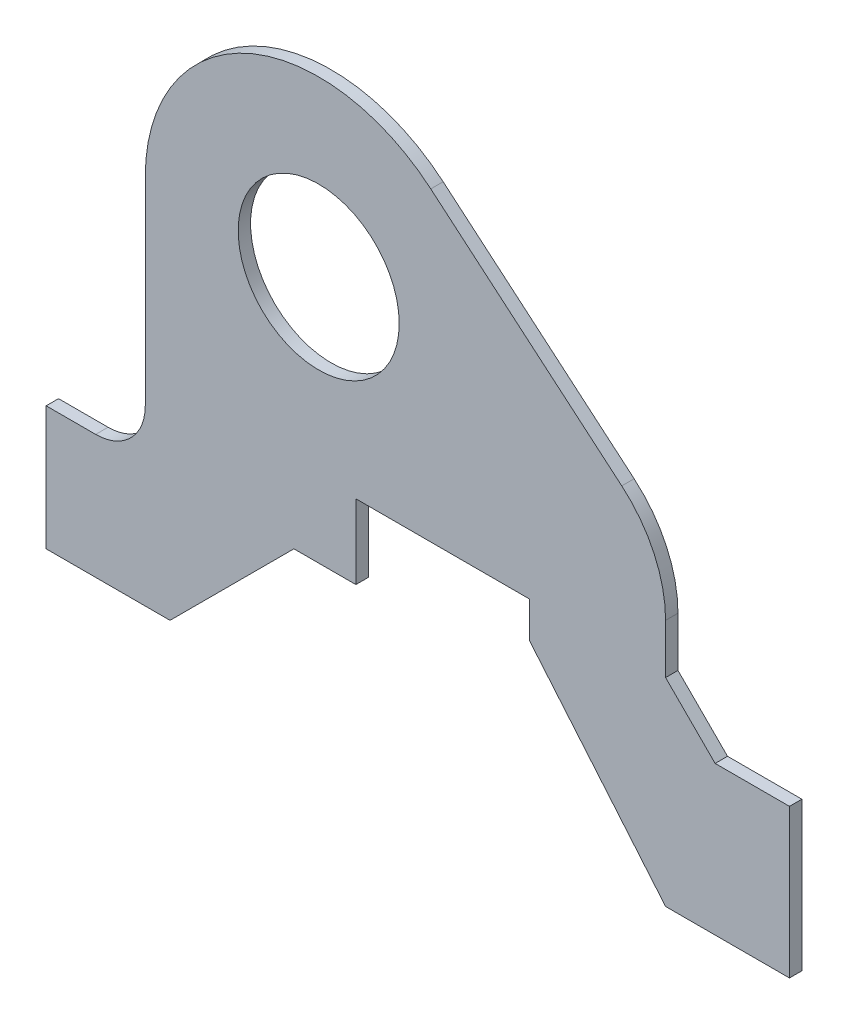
from build123d import *

# Parameters (mm, degrees)
CROQUIS1_R              = 6.5
SALIENTE_EXTRUIR1_DEPTH = 1


with BuildPart() as part:
    # Croquis1 → Saliente-Extruir1 (new body)
    with BuildSketch(Plane.XY):
        with BuildLine():
            Line((0, 0), (0, 10))
            Line((0, 10), (4, 10))
            ThreePointArc((4, 10), (6.828427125, 11.171572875), (8, 14))
            Line((8, 14), (8, 30))
            ThreePointArc((8, 30), (16.111698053, 42.701492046), (31.046842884, 40.684317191))
            Line((31.046842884, 40.684317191), (46.462030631, 27.631655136))
            ThreePointArc((46.462030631, 27.631655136), (49.072494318, 24.205929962), (50, 20))
            Line((50, 20), (50, 16))
            Line((50, 16), (54, 12))
            Line((54, 12), (60, 12))
            Line((60, 12), (60, 0))
            Line((60, 0), (50, 0))
            Line((50, 0), (39, 13.109289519))
            Line((39, 13.109289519), (39, 16))
            Line((39, 16), (25, 16))
            Line((25, 16), (25, 10))
            Line((25, 10), (20, 10))
            Line((20, 10), (10, 0))
            Line((10, 0), (0, 0))
        make_face()
        with Locations((22, 30)):
            Circle(CROQUIS1_R, mode=Mode.SUBTRACT)
    extrude(amount=SALIENTE_EXTRUIR1_DEPTH)


solid = part.part
